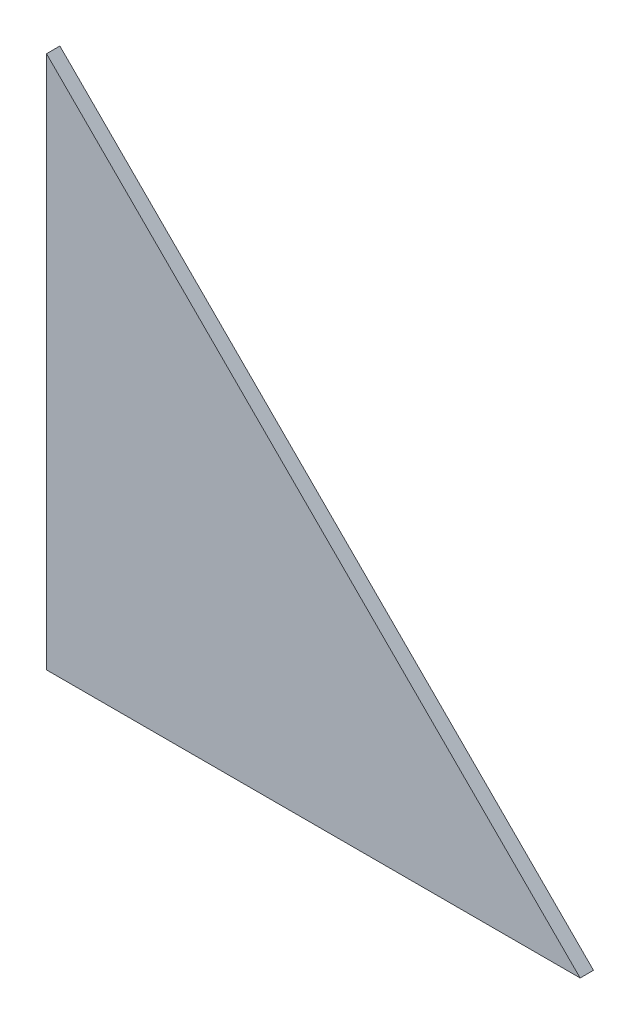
from build123d import *

# Parameters (mm, degrees)
ESTRUSIONE_ESTRUSIONE1_DEPTH = 2


with BuildPart() as part:
    # Schizzo1 → Estrusione-Estrusione1 (new body)
    with BuildSketch(Plane.XY):
        Polygon((0, 0), (0, 80), (80, 0), align=None)
    extrude(amount=ESTRUSIONE_ESTRUSIONE1_DEPTH)


solid = part.part
